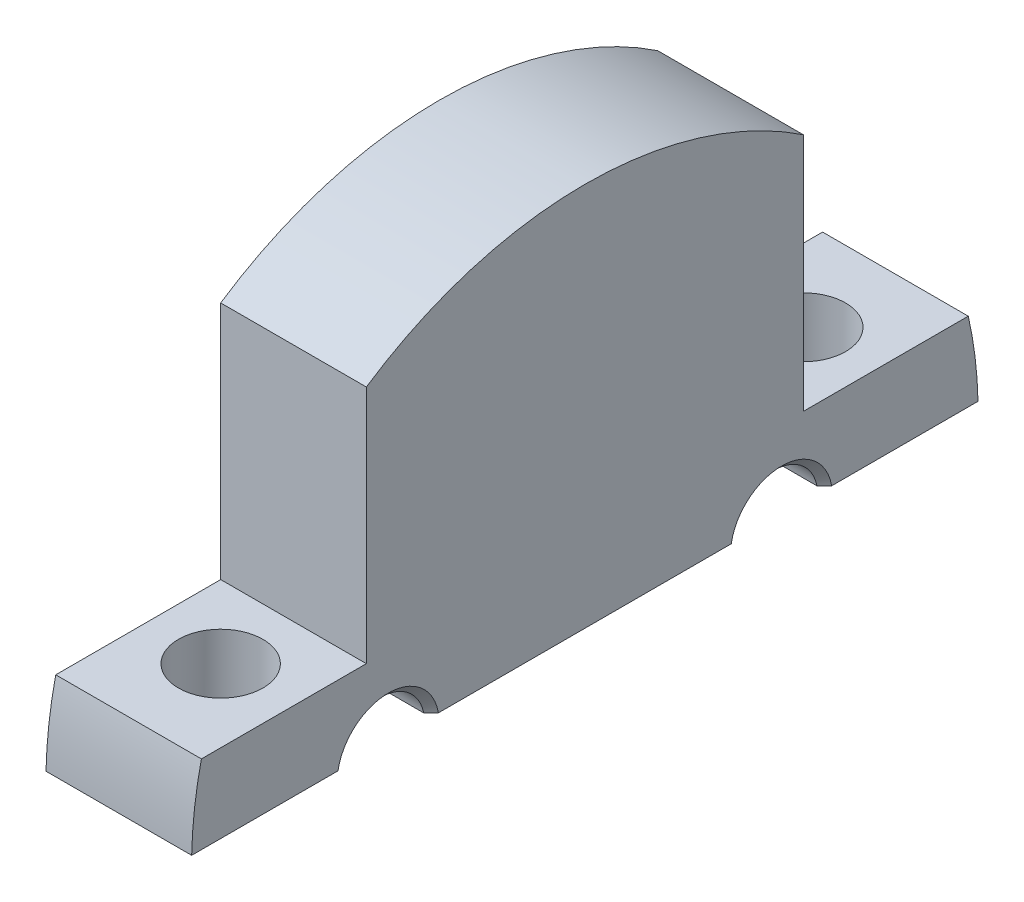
ISO-10303-21;
HEADER;
FILE_DESCRIPTION(('STEP AP214'),'2;1');
FILE_NAME('part.step','',(''),(''),'','','');
FILE_SCHEMA(('AUTOMOTIVE_DESIGN { 1 0 10303 214 1 1 1 1 }'));
ENDSEC;
DATA;
#1=APPLICATION_CONTEXT('core data for automotive mechanical design processes');
#2=APPLICATION_PROTOCOL_DEFINITION('international standard','automotive_design',2000,#1);
#3=PRODUCT_CONTEXT('',#1,'mechanical');
#4=PRODUCT('Part','Part','',(#3));
#5=PRODUCT_RELATED_PRODUCT_CATEGORY('part','',(#4));
#6=PRODUCT_DEFINITION_FORMATION('','',#4);
#7=PRODUCT_DEFINITION_CONTEXT('part definition',#1,'design');
#8=PRODUCT_DEFINITION('design','',#6,#7);
#9=PRODUCT_DEFINITION_SHAPE('','',#8);
#10=(LENGTH_UNIT() NAMED_UNIT(*) SI_UNIT(.MILLI.,.METRE.));
#11=(NAMED_UNIT(*) PLANE_ANGLE_UNIT() SI_UNIT($,.RADIAN.));
#12=(NAMED_UNIT(*) SI_UNIT($,.STERADIAN.) SOLID_ANGLE_UNIT());
#13=UNCERTAINTY_MEASURE_WITH_UNIT(LENGTH_MEASURE(1.E-05),#10,'distance_accuracy_value','');
#14=(GEOMETRIC_REPRESENTATION_CONTEXT(3) GLOBAL_UNCERTAINTY_ASSIGNED_CONTEXT((#13)) GLOBAL_UNIT_ASSIGNED_CONTEXT((#10,
#11,#12)) REPRESENTATION_CONTEXT('',''));
#15=CARTESIAN_POINT('',(0.,0.,0.));
#16=DIRECTION('',(0.,0.,1.));
#17=DIRECTION('',(1.,0.,0.));
#18=AXIS2_PLACEMENT_3D('',#15,#16,#17);
#19=CARTESIAN_POINT('',(132.700000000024,0.,0.));
#20=DIRECTION('',(1.,0.,0.));
#21=DIRECTION('',(0.,1.,0.));
#22=AXIS2_PLACEMENT_3D('',#19,#20,#21);
#23=CYLINDRICAL_SURFACE('',#22,13.5);
#24=DIRECTION('',(1.,0.,0.));
#25=VECTOR('',#24,1.);
#26=CARTESIAN_POINT('',(132.700000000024,0.300000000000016,13.4966662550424));
#27=LINE('',#26,#25);
#28=CARTESIAN_POINT('',(132.700000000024,0.300000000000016,13.4966662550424));
#29=VERTEX_POINT('',#28);
#30=CARTESIAN_POINT('',(127.700000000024,0.300000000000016,13.4966662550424));
#31=VERTEX_POINT('',#30);
#32=EDGE_CURVE('E151',#29,#31,#27,.F.);
#33=ORIENTED_EDGE('',*,*,#32,.F.);
#34=CARTESIAN_POINT('',(132.700000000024,0.,0.));
#35=DIRECTION('',(1.,0.,0.));
#36=DIRECTION('',(0.,1.,0.));
#37=AXIS2_PLACEMENT_3D('',#34,#35,#36);
#38=CIRCLE('',#37,13.5);
#39=CARTESIAN_POINT('',(132.700000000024,2.99999999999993,13.1624465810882));
#40=VERTEX_POINT('',#39);
#41=EDGE_CURVE('E165',#40,#29,#38,.T.);
#42=ORIENTED_EDGE('',*,*,#41,.F.);
#43=DIRECTION('',(-1.,0.,0.));
#44=VECTOR('',#43,1.);
#45=CARTESIAN_POINT('',(132.700000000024,2.99999999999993,13.1624465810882));
#46=LINE('',#45,#44);
#47=CARTESIAN_POINT('',(127.700000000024,2.99999999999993,13.1624465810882));
#48=VERTEX_POINT('',#47);
#49=EDGE_CURVE('E347',#40,#48,#46,.T.);
#50=ORIENTED_EDGE('',*,*,#49,.T.);
#51=CARTESIAN_POINT('',(127.700000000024,0.,0.));
#52=DIRECTION('',(1.,0.,0.));
#53=DIRECTION('',(0.,1.,0.));
#54=AXIS2_PLACEMENT_3D('',#51,#52,#53);
#55=CIRCLE('',#54,13.5);
#56=EDGE_CURVE('E167',#48,#31,#55,.T.);
#57=ORIENTED_EDGE('',*,*,#56,.T.);
#58=EDGE_LOOP('',(#33,#42,#50,#57));
#59=FACE_BOUND('',#58,.T.);
#60=ADVANCED_FACE('F32',(#59),#23,.T.);
#61=DIRECTION('',(-1.,0.,0.));
#62=VECTOR('',#61,1.);
#63=CARTESIAN_POINT('',(132.700000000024,11.2249721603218,7.5));
#64=LINE('',#63,#62);
#65=CARTESIAN_POINT('',(132.700000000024,11.2249721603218,7.5));
#66=VERTEX_POINT('',#65);
#67=CARTESIAN_POINT('',(127.700000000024,11.2249721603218,7.5));
#68=VERTEX_POINT('',#67);
#69=EDGE_CURVE('E328',#66,#68,#64,.T.);
#70=ORIENTED_EDGE('',*,*,#69,.F.);
#71=CARTESIAN_POINT('',(132.700000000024,11.2249721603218,-7.5));
#72=VERTEX_POINT('',#71);
#73=EDGE_CURVE('E175',#72,#66,#38,.T.);
#74=ORIENTED_EDGE('',*,*,#73,.F.);
#75=DIRECTION('',(-1.,0.,0.));
#76=VECTOR('',#75,1.);
#77=CARTESIAN_POINT('',(132.700000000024,11.2249721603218,-7.5));
#78=LINE('',#77,#76);
#79=CARTESIAN_POINT('',(127.700000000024,11.2249721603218,-7.5));
#80=VERTEX_POINT('',#79);
#81=EDGE_CURVE('E176',#72,#80,#78,.T.);
#82=ORIENTED_EDGE('',*,*,#81,.T.);
#83=EDGE_CURVE('E188',#80,#68,#55,.T.);
#84=ORIENTED_EDGE('',*,*,#83,.T.);
#85=EDGE_LOOP('',(#70,#74,#82,#84));
#86=FACE_BOUND('',#85,.T.);
#87=ADVANCED_FACE('F283',(#86),#23,.T.);
#88=CARTESIAN_POINT('',(127.700000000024,0.,0.));
#89=DIRECTION('',(-1.,0.,0.));
#90=DIRECTION('',(0.,-1.,0.));
#91=AXIS2_PLACEMENT_3D('',#88,#89,#90);
#92=PLANE('',#91);
#93=DIRECTION('',(0.,0.,-1.));
#94=VECTOR('',#93,1.);
#95=CARTESIAN_POINT('',(127.700000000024,0.300000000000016,-13.5));
#96=LINE('',#95,#94);
#97=CARTESIAN_POINT('',(127.700000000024,0.300000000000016,8.47409396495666));
#98=VERTEX_POINT('',#97);
#99=EDGE_CURVE('E382',#31,#98,#96,.T.);
#100=ORIENTED_EDGE('',*,*,#99,.F.);
#101=ORIENTED_EDGE('',*,*,#56,.F.);
#102=DIRECTION('',(0.,0.,1.));
#103=VECTOR('',#102,1.);
#104=CARTESIAN_POINT('',(127.700000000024,2.99999999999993,7.5));
#105=LINE('',#104,#103);
#106=CARTESIAN_POINT('',(127.700000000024,2.99999999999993,7.5));
#107=VERTEX_POINT('',#106);
#108=EDGE_CURVE('E354',#107,#48,#105,.T.);
#109=ORIENTED_EDGE('',*,*,#108,.F.);
#110=DIRECTION('',(0.,-1.,0.));
#111=VECTOR('',#110,1.);
#112=CARTESIAN_POINT('',(127.700000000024,11.2249721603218,7.5));
#113=LINE('',#112,#111);
#114=EDGE_CURVE('E353',#68,#107,#113,.T.);
#115=ORIENTED_EDGE('',*,*,#114,.F.);
#116=ORIENTED_EDGE('',*,*,#83,.F.);
#117=DIRECTION('',(0.,1.,0.));
#118=VECTOR('',#117,1.);
#119=CARTESIAN_POINT('',(127.700000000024,11.2249721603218,-7.5));
#120=LINE('',#119,#118);
#121=CARTESIAN_POINT('',(127.700000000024,2.99999999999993,-7.5));
#122=VERTEX_POINT('',#121);
#123=EDGE_CURVE('E341',#122,#80,#120,.T.);
#124=ORIENTED_EDGE('',*,*,#123,.F.);
#125=DIRECTION('',(0.,0.,1.));
#126=VECTOR('',#125,1.);
#127=CARTESIAN_POINT('',(127.700000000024,2.99999999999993,-7.5));
#128=LINE('',#127,#126);
#129=CARTESIAN_POINT('',(127.700000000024,2.99999999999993,-13.1624465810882));
#130=VERTEX_POINT('',#129);
#131=EDGE_CURVE('E344',#130,#122,#128,.T.);
#132=ORIENTED_EDGE('',*,*,#131,.F.);
#133=CARTESIAN_POINT('',(127.700000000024,0.300000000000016,-13.4966662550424));
#134=VERTEX_POINT('',#133);
#135=EDGE_CURVE('E189',#134,#130,#55,.T.);
#136=ORIENTED_EDGE('',*,*,#135,.F.);
#137=CARTESIAN_POINT('',(127.700000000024,0.300000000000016,-8.47409396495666));
#138=VERTEX_POINT('',#137);
#139=EDGE_CURVE('E387',#138,#134,#96,.T.);
#140=ORIENTED_EDGE('',*,*,#139,.F.);
#141=CARTESIAN_POINT('',(127.700000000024,0.,-6.75));
#142=DIRECTION('',(-1.,0.,0.));
#143=DIRECTION('',(0.,-1.,0.));
#144=AXIS2_PLACEMENT_3D('',#141,#142,#143);
#145=CIRCLE('',#144,1.75000000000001);
#146=CARTESIAN_POINT('',(127.700000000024,0.300000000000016,-5.02590603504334));
#147=VERTEX_POINT('',#146);
#148=EDGE_CURVE('E210',#138,#147,#145,.F.);
#149=ORIENTED_EDGE('',*,*,#148,.T.);
#150=CARTESIAN_POINT('',(127.700000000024,0.300000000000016,5.02590603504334));
#151=VERTEX_POINT('',#150);
#152=EDGE_CURVE('E383',#151,#147,#96,.T.);
#153=ORIENTED_EDGE('',*,*,#152,.F.);
#154=CARTESIAN_POINT('',(127.700000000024,0.,6.75));
#155=DIRECTION('',(-1.,0.,0.));
#156=DIRECTION('',(0.,-1.,0.));
#157=AXIS2_PLACEMENT_3D('',#154,#155,#156);
#158=CIRCLE('',#157,1.75000000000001);
#159=EDGE_CURVE('E205',#151,#98,#158,.F.);
#160=ORIENTED_EDGE('',*,*,#159,.T.);
#161=EDGE_LOOP('',(#100,#101,#109,#115,#116,#124,#132,#136,#140,#149,#153,#160));
#162=FACE_BOUND('',#161,.T.);
#163=ADVANCED_FACE('F279',(#162),#92,.T.);
#164=DIRECTION('',(1.,0.,0.));
#165=VECTOR('',#164,1.);
#166=CARTESIAN_POINT('',(132.700000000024,0.300000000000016,-13.4966662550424));
#167=LINE('',#166,#165);
#168=CARTESIAN_POINT('',(132.700000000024,0.300000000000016,-13.4966662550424));
#169=VERTEX_POINT('',#168);
#170=EDGE_CURVE('E169',#134,#169,#167,.T.);
#171=ORIENTED_EDGE('',*,*,#170,.F.);
#172=ORIENTED_EDGE('',*,*,#135,.T.);
#173=DIRECTION('',(-1.,0.,0.));
#174=VECTOR('',#173,1.);
#175=CARTESIAN_POINT('',(132.700000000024,2.99999999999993,-13.1624465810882));
#176=LINE('',#175,#174);
#177=CARTESIAN_POINT('',(132.700000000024,2.99999999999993,-13.1624465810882));
#178=VERTEX_POINT('',#177);
#179=EDGE_CURVE('E339',#178,#130,#176,.T.);
#180=ORIENTED_EDGE('',*,*,#179,.F.);
#181=EDGE_CURVE('E178',#169,#178,#38,.T.);
#182=ORIENTED_EDGE('',*,*,#181,.F.);
#183=EDGE_LOOP('',(#171,#172,#180,#182));
#184=FACE_BOUND('',#183,.T.);
#185=ADVANCED_FACE('F282',(#184),#23,.T.);
#186=CARTESIAN_POINT('',(132.700000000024,0.,-8.64999999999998));
#187=DIRECTION('',(1.,0.,0.));
#188=DIRECTION('',(0.,1.,0.));
#189=AXIS2_PLACEMENT_3D('',#186,#187,#188);
#190=PLANE('',#189);
#191=DIRECTION('',(0.,0.,-1.));
#192=VECTOR('',#191,1.);
#193=CARTESIAN_POINT('',(132.700000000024,0.300000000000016,-13.5));
#194=LINE('',#193,#192);
#195=CARTESIAN_POINT('',(132.700000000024,0.300000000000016,-8.47409396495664));
#196=VERTEX_POINT('',#195);
#197=EDGE_CURVE('E59',#196,#169,#194,.T.);
#198=ORIENTED_EDGE('',*,*,#197,.T.);
#199=ORIENTED_EDGE('',*,*,#181,.T.);
#200=DIRECTION('',(0.,0.,1.));
#201=VECTOR('',#200,1.);
#202=CARTESIAN_POINT('',(132.700000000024,2.99999999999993,-7.5));
#203=LINE('',#202,#201);
#204=CARTESIAN_POINT('',(132.700000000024,2.99999999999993,-7.5));
#205=VERTEX_POINT('',#204);
#206=EDGE_CURVE('E337',#178,#205,#203,.T.);
#207=ORIENTED_EDGE('',*,*,#206,.T.);
#208=DIRECTION('',(0.,1.,0.));
#209=VECTOR('',#208,1.);
#210=CARTESIAN_POINT('',(132.700000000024,11.2249721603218,-7.5));
#211=LINE('',#210,#209);
#212=EDGE_CURVE('E336',#205,#72,#211,.T.);
#213=ORIENTED_EDGE('',*,*,#212,.T.);
#214=ORIENTED_EDGE('',*,*,#73,.T.);
#215=DIRECTION('',(0.,-1.,0.));
#216=VECTOR('',#215,1.);
#217=CARTESIAN_POINT('',(132.700000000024,11.2249721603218,7.5));
#218=LINE('',#217,#216);
#219=CARTESIAN_POINT('',(132.700000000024,2.99999999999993,7.5));
#220=VERTEX_POINT('',#219);
#221=EDGE_CURVE('E335',#66,#220,#218,.T.);
#222=ORIENTED_EDGE('',*,*,#221,.T.);
#223=DIRECTION('',(0.,0.,1.));
#224=VECTOR('',#223,1.);
#225=CARTESIAN_POINT('',(132.700000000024,2.99999999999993,7.5));
#226=LINE('',#225,#224);
#227=EDGE_CURVE('E174',#220,#40,#226,.T.);
#228=ORIENTED_EDGE('',*,*,#227,.T.);
#229=ORIENTED_EDGE('',*,*,#41,.T.);
#230=CARTESIAN_POINT('',(132.700000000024,0.300000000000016,8.47409396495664));
#231=VERTEX_POINT('',#230);
#232=EDGE_CURVE('E147',#29,#231,#194,.T.);
#233=ORIENTED_EDGE('',*,*,#232,.T.);
#234=CARTESIAN_POINT('',(132.700000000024,0.,6.75));
#235=DIRECTION('',(1.,0.,0.));
#236=DIRECTION('',(0.,1.,0.));
#237=AXIS2_PLACEMENT_3D('',#234,#235,#236);
#238=CIRCLE('',#237,1.74999999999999);
#239=CARTESIAN_POINT('',(132.700000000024,0.300000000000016,5.02590603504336));
#240=VERTEX_POINT('',#239);
#241=EDGE_CURVE('E221',#231,#240,#238,.F.);
#242=ORIENTED_EDGE('',*,*,#241,.T.);
#243=CARTESIAN_POINT('',(132.700000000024,0.300000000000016,-5.02590603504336));
#244=VERTEX_POINT('',#243);
#245=EDGE_CURVE('E159',#240,#244,#194,.T.);
#246=ORIENTED_EDGE('',*,*,#245,.T.);
#247=CARTESIAN_POINT('',(132.700000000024,0.,-6.75));
#248=DIRECTION('',(1.,0.,0.));
#249=DIRECTION('',(0.,1.,0.));
#250=AXIS2_PLACEMENT_3D('',#247,#248,#249);
#251=CIRCLE('',#250,1.74999999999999);
#252=EDGE_CURVE('E219',#244,#196,#251,.F.);
#253=ORIENTED_EDGE('',*,*,#252,.T.);
#254=EDGE_LOOP('',(#198,#199,#207,#213,#214,#222,#228,#229,#233,#242,#246,#253));
#255=FACE_BOUND('',#254,.T.);
#256=ADVANCED_FACE('F172',(#255),#190,.T.);
#257=CARTESIAN_POINT('',(132.700000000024,0.,-6.75));
#258=DIRECTION('',(-1.,0.,0.));
#259=DIRECTION('',(0.,-1.,0.));
#260=AXIS2_PLACEMENT_3D('',#257,#258,#259);
#261=CYLINDRICAL_SURFACE('',#260,1.5);
#262=CARTESIAN_POINT('',(127.950000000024,0.,-6.75));
#263=DIRECTION('',(-1.,0.,0.));
#264=DIRECTION('',(0.,-1.,0.));
#265=AXIS2_PLACEMENT_3D('',#262,#263,#264);
#266=CIRCLE('',#265,1.5);
#267=CARTESIAN_POINT('',(127.950000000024,0.300000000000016,-5.28030615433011));
#268=VERTEX_POINT('',#267);
#269=CARTESIAN_POINT('',(127.950000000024,0.300000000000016,-8.21969384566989));
#270=VERTEX_POINT('',#269);
#271=EDGE_CURVE('E199',#268,#270,#266,.T.);
#272=ORIENTED_EDGE('',*,*,#271,.T.);
#273=DIRECTION('',(-1.,0.,0.));
#274=VECTOR('',#273,1.);
#275=CARTESIAN_POINT('',(132.700000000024,0.300000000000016,-8.21969384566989));
#276=LINE('',#275,#274);
#277=CARTESIAN_POINT('',(132.450000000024,0.300000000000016,-8.21969384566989));
#278=VERTEX_POINT('',#277);
#279=EDGE_CURVE('E231',#270,#278,#276,.F.);
#280=ORIENTED_EDGE('',*,*,#279,.T.);
#281=CARTESIAN_POINT('',(132.450000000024,0.,-6.75));
#282=DIRECTION('',(1.,0.,0.));
#283=DIRECTION('',(0.,1.,0.));
#284=AXIS2_PLACEMENT_3D('',#281,#282,#283);
#285=CIRCLE('',#284,1.5);
#286=CARTESIAN_POINT('',(132.450000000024,0.300000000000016,-5.28030615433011));
#287=VERTEX_POINT('',#286);
#288=EDGE_CURVE('E192',#278,#287,#285,.T.);
#289=ORIENTED_EDGE('',*,*,#288,.T.);
#290=DIRECTION('',(-1.,0.,0.));
#291=VECTOR('',#290,1.);
#292=CARTESIAN_POINT('',(132.700000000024,0.300000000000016,-5.28030615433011));
#293=LINE('',#292,#291);
#294=EDGE_CURVE('E158',#287,#268,#293,.T.);
#295=ORIENTED_EDGE('',*,*,#294,.T.);
#296=EDGE_LOOP('',(#272,#280,#289,#295));
#297=FACE_BOUND('',#296,.T.);
#298=ADVANCED_FACE('F233',(#297),#261,.F.);
#299=CARTESIAN_POINT('',(132.700000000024,0.,6.75));
#300=DIRECTION('',(-1.,0.,0.));
#301=DIRECTION('',(0.,-1.,0.));
#302=AXIS2_PLACEMENT_3D('',#299,#300,#301);
#303=CYLINDRICAL_SURFACE('',#302,1.5);
#304=CARTESIAN_POINT('',(127.950000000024,0.,6.75));
#305=DIRECTION('',(-1.,0.,0.));
#306=DIRECTION('',(0.,-1.,0.));
#307=AXIS2_PLACEMENT_3D('',#304,#305,#306);
#308=CIRCLE('',#307,1.5);
#309=CARTESIAN_POINT('',(127.950000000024,0.300000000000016,8.21969384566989));
#310=VERTEX_POINT('',#309);
#311=CARTESIAN_POINT('',(127.950000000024,0.300000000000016,5.28030615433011));
#312=VERTEX_POINT('',#311);
#313=EDGE_CURVE('E216',#310,#312,#308,.T.);
#314=ORIENTED_EDGE('',*,*,#313,.T.);
#315=DIRECTION('',(-1.,0.,0.));
#316=VECTOR('',#315,1.);
#317=CARTESIAN_POINT('',(132.700000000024,0.300000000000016,5.28030615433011));
#318=LINE('',#317,#316);
#319=CARTESIAN_POINT('',(132.450000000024,0.300000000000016,5.28030615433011));
#320=VERTEX_POINT('',#319);
#321=EDGE_CURVE('E268',#312,#320,#318,.F.);
#322=ORIENTED_EDGE('',*,*,#321,.T.);
#323=CARTESIAN_POINT('',(132.450000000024,0.,6.75));
#324=DIRECTION('',(1.,0.,0.));
#325=DIRECTION('',(0.,1.,0.));
#326=AXIS2_PLACEMENT_3D('',#323,#324,#325);
#327=CIRCLE('',#326,1.5);
#328=CARTESIAN_POINT('',(132.450000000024,0.300000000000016,8.21969384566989));
#329=VERTEX_POINT('',#328);
#330=EDGE_CURVE('E213',#320,#329,#327,.T.);
#331=ORIENTED_EDGE('',*,*,#330,.T.);
#332=DIRECTION('',(-1.,0.,0.));
#333=VECTOR('',#332,1.);
#334=CARTESIAN_POINT('',(132.700000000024,0.300000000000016,8.21969384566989));
#335=LINE('',#334,#333);
#336=EDGE_CURVE('E52',#329,#310,#335,.T.);
#337=ORIENTED_EDGE('',*,*,#336,.T.);
#338=EDGE_LOOP('',(#314,#322,#331,#337));
#339=FACE_BOUND('',#338,.T.);
#340=ADVANCED_FACE('F291',(#339),#303,.F.);
#341=CARTESIAN_POINT('',(132.700000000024,11.2249721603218,-7.5));
#342=DIRECTION('',(0.,0.,1.));
#343=DIRECTION('',(1.,0.,0.));
#344=AXIS2_PLACEMENT_3D('',#341,#342,#343);
#345=PLANE('',#344);
#346=ORIENTED_EDGE('',*,*,#123,.T.);
#347=ORIENTED_EDGE('',*,*,#81,.F.);
#348=ORIENTED_EDGE('',*,*,#212,.F.);
#349=DIRECTION('',(-1.,0.,0.));
#350=VECTOR('',#349,1.);
#351=CARTESIAN_POINT('',(132.700000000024,2.99999999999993,-7.5));
#352=LINE('',#351,#350);
#353=EDGE_CURVE('E181',#205,#122,#352,.T.);
#354=ORIENTED_EDGE('',*,*,#353,.T.);
#355=EDGE_LOOP('',(#346,#347,#348,#354));
#356=FACE_BOUND('',#355,.T.);
#357=ADVANCED_FACE('F294',(#356),#345,.F.);
#358=CARTESIAN_POINT('',(132.700000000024,2.99999999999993,-7.5));
#359=DIRECTION('',(0.,-1.,0.));
#360=DIRECTION('',(0.,0.,-1.));
#361=AXIS2_PLACEMENT_3D('',#358,#359,#360);
#362=PLANE('',#361);
#363=CARTESIAN_POINT('',(130.200000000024,2.99999999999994,-10.));
#364=DIRECTION('',(0.,1.,0.));
#365=DIRECTION('',(0.,0.,1.));
#366=AXIS2_PLACEMENT_3D('',#363,#364,#365);
#367=CIRCLE('',#366,1.44999999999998);
#368=CARTESIAN_POINT('',(130.200000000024,2.99999999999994,-8.55000000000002));
#369=VERTEX_POINT('',#368);
#370=EDGE_CURVE('E356',#369,#369,#367,.T.);
#371=ORIENTED_EDGE('',*,*,#370,.F.);
#372=EDGE_LOOP('',(#371));
#373=FACE_BOUND('',#372,.T.);
#374=ORIENTED_EDGE('',*,*,#131,.T.);
#375=ORIENTED_EDGE('',*,*,#353,.F.);
#376=ORIENTED_EDGE('',*,*,#206,.F.);
#377=ORIENTED_EDGE('',*,*,#179,.T.);
#378=EDGE_LOOP('',(#374,#375,#376,#377));
#379=FACE_BOUND('',#378,.T.);
#380=ADVANCED_FACE('F296',(#373,#379),#362,.F.);
#381=CARTESIAN_POINT('',(132.700000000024,2.99999999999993,7.5));
#382=DIRECTION('',(0.,-1.,0.));
#383=DIRECTION('',(0.,0.,-1.));
#384=AXIS2_PLACEMENT_3D('',#381,#382,#383);
#385=PLANE('',#384);
#386=CARTESIAN_POINT('',(130.200000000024,2.99999999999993,10.));
#387=DIRECTION('',(0.,1.,0.));
#388=DIRECTION('',(0.,0.,1.));
#389=AXIS2_PLACEMENT_3D('',#386,#387,#388);
#390=CIRCLE('',#389,1.44999999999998);
#391=CARTESIAN_POINT('',(130.200000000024,2.99999999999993,11.45));
#392=VERTEX_POINT('',#391);
#393=EDGE_CURVE('E168',#392,#392,#390,.T.);
#394=ORIENTED_EDGE('',*,*,#393,.F.);
#395=EDGE_LOOP('',(#394));
#396=FACE_BOUND('',#395,.T.);
#397=ORIENTED_EDGE('',*,*,#108,.T.);
#398=ORIENTED_EDGE('',*,*,#49,.F.);
#399=ORIENTED_EDGE('',*,*,#227,.F.);
#400=DIRECTION('',(-1.,0.,0.));
#401=VECTOR('',#400,1.);
#402=CARTESIAN_POINT('',(132.700000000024,2.99999999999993,7.5));
#403=LINE('',#402,#401);
#404=EDGE_CURVE('E332',#220,#107,#403,.T.);
#405=ORIENTED_EDGE('',*,*,#404,.T.);
#406=EDGE_LOOP('',(#397,#398,#399,#405));
#407=FACE_BOUND('',#406,.T.);
#408=ADVANCED_FACE('F299',(#396,#407),#385,.F.);
#409=CARTESIAN_POINT('',(132.700000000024,11.2249721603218,7.5));
#410=DIRECTION('',(0.,0.,-1.));
#411=DIRECTION('',(-1.,0.,0.));
#412=AXIS2_PLACEMENT_3D('',#409,#410,#411);
#413=PLANE('',#412);
#414=ORIENTED_EDGE('',*,*,#114,.T.);
#415=ORIENTED_EDGE('',*,*,#404,.F.);
#416=ORIENTED_EDGE('',*,*,#221,.F.);
#417=ORIENTED_EDGE('',*,*,#69,.T.);
#418=EDGE_LOOP('',(#414,#415,#416,#417));
#419=FACE_BOUND('',#418,.T.);
#420=ADVANCED_FACE('F304',(#419),#413,.F.);
#421=CARTESIAN_POINT('',(130.200000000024,2.99999999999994,-10.));
#422=DIRECTION('',(0.,1.,0.));
#423=DIRECTION('',(0.,0.,1.));
#424=AXIS2_PLACEMENT_3D('',#421,#422,#423);
#425=CYLINDRICAL_SURFACE('',#424,1.44999999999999);
#426=CARTESIAN_POINT('',(130.200000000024,0.300000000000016,-10.));
#427=DIRECTION('',(0.,1.,0.));
#428=DIRECTION('',(-1.,0.,0.));
#429=AXIS2_PLACEMENT_3D('',#426,#427,#428);
#430=CIRCLE('',#429,1.44999999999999);
#431=CARTESIAN_POINT('',(128.750000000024,0.300000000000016,-10.));
#432=VERTEX_POINT('',#431);
#433=EDGE_CURVE('E370',#432,#432,#430,.F.);
#434=ORIENTED_EDGE('',*,*,#433,.T.);
#435=EDGE_LOOP('',(#434));
#436=FACE_BOUND('',#435,.T.);
#437=ORIENTED_EDGE('',*,*,#370,.T.);
#438=EDGE_LOOP('',(#437));
#439=FACE_BOUND('',#438,.T.);
#440=ADVANCED_FACE('F307',(#436,#439),#425,.F.);
#441=CARTESIAN_POINT('',(130.200000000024,2.99999999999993,10.));
#442=DIRECTION('',(0.,1.,0.));
#443=DIRECTION('',(0.,0.,1.));
#444=AXIS2_PLACEMENT_3D('',#441,#442,#443);
#445=CYLINDRICAL_SURFACE('',#444,1.44999999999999);
#446=CARTESIAN_POINT('',(130.200000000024,0.300000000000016,10.));
#447=DIRECTION('',(0.,1.,0.));
#448=DIRECTION('',(-1.,0.,0.));
#449=AXIS2_PLACEMENT_3D('',#446,#447,#448);
#450=CIRCLE('',#449,1.44999999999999);
#451=CARTESIAN_POINT('',(128.750000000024,0.300000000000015,10.));
#452=VERTEX_POINT('',#451);
#453=EDGE_CURVE('E371',#452,#452,#450,.F.);
#454=ORIENTED_EDGE('',*,*,#453,.T.);
#455=EDGE_LOOP('',(#454));
#456=FACE_BOUND('',#455,.T.);
#457=ORIENTED_EDGE('',*,*,#393,.T.);
#458=EDGE_LOOP('',(#457));
#459=FACE_BOUND('',#458,.T.);
#460=ADVANCED_FACE('F257',(#456,#459),#445,.F.);
#461=CARTESIAN_POINT('',(127.950000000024,0.,-6.75));
#462=DIRECTION('',(-1.,0.,0.));
#463=DIRECTION('',(0.,-1.,0.));
#464=AXIS2_PLACEMENT_3D('',#461,#462,#463);
#465=CONICAL_SURFACE('',#464,1.5,0.78539816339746);
#466=CARTESIAN_POINT('',(125.594449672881,0.300000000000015,-2.906138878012));
#467=CARTESIAN_POINT('',(125.730486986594,0.300000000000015,-3.04259368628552));
#468=CARTESIAN_POINT('',(125.866505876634,0.300000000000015,-3.1790668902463));
#469=CARTESIAN_POINT('',(126.138486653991,0.300000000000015,-3.45208109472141));
#470=CARTESIAN_POINT('',(126.274448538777,0.300000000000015,-3.58862209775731));
#471=CARTESIAN_POINT('',(126.546417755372,0.300000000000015,-3.86192614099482));
#472=CARTESIAN_POINT('',(126.682425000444,0.300000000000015,-3.99868926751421));
#473=CARTESIAN_POINT('',(126.954298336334,0.300000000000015,-4.27234513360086));
#474=CARTESIAN_POINT('',(127.090164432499,0.300000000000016,-4.40923786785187));
#475=CARTESIAN_POINT('',(127.35522866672,0.300000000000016,-4.67674768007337));
#476=CARTESIAN_POINT('',(127.484437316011,0.300000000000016,-4.80735434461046));
#477=CARTESIAN_POINT('',(127.742513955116,0.300000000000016,-5.06893388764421));
#478=CARTESIAN_POINT('',(127.871381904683,0.300000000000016,-5.19990680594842));
#479=CARTESIAN_POINT('',(128.064083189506,0.300000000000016,-5.39687659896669));
#480=CARTESIAN_POINT('',(128.128197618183,0.300000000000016,-5.46259838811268));
#481=CARTESIAN_POINT('',(128.256134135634,0.300000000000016,-5.59433249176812));
#482=CARTESIAN_POINT('',(128.319956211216,0.300000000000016,-5.66034481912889));
#483=CARTESIAN_POINT('',(128.447090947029,0.300000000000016,-5.79283134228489));
#484=CARTESIAN_POINT('',(128.510403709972,0.300000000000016,-5.85930543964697));
#485=CARTESIAN_POINT('',(128.636140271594,0.300000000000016,-5.99308780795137));
#486=CARTESIAN_POINT('',(128.698564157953,0.300000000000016,-6.06039599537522));
#487=CARTESIAN_POINT('',(128.777062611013,0.300000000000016,-6.14758136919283));
#488=CARTESIAN_POINT('',(128.79406461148,0.300000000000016,-6.16662137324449));
#489=CARTESIAN_POINT('',(128.827857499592,0.300000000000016,-6.20489154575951));
#490=CARTESIAN_POINT('',(128.844648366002,0.300000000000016,-6.22412173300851));
#491=CARTESIAN_POINT('',(128.878079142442,0.300000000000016,-6.26297623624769));
#492=CARTESIAN_POINT('',(128.894716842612,0.300000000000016,-6.28260245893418));
#493=CARTESIAN_POINT('',(128.927593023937,0.300000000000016,-6.32217911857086));
#494=CARTESIAN_POINT('',(128.943831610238,0.300000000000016,-6.34212946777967));
#495=CARTESIAN_POINT('',(128.975888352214,0.300000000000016,-6.38266154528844));
#496=CARTESIAN_POINT('',(128.991701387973,0.300000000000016,-6.40324734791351));
#497=CARTESIAN_POINT('',(129.022460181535,0.300000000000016,-6.44505507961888));
#498=CARTESIAN_POINT('',(129.037406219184,0.300000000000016,-6.46627680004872));
#499=CARTESIAN_POINT('',(129.065838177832,0.300000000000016,-6.50949091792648));
#500=CARTESIAN_POINT('',(129.079333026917,0.300000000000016,-6.53147735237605));
#501=CARTESIAN_POINT('',(129.104045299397,0.300000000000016,-6.57667239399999));
#502=CARTESIAN_POINT('',(129.115269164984,0.300000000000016,-6.59987730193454));
#503=CARTESIAN_POINT('',(129.13157516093,0.300000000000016,-6.64196917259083));
#504=CARTESIAN_POINT('',(129.137488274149,0.300000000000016,-6.66052148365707));
#505=CARTESIAN_POINT('',(129.146129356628,0.300000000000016,-6.69831457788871));
#506=CARTESIAN_POINT('',(129.148871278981,0.300000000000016,-6.71755195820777));
#507=CARTESIAN_POINT('',(129.150561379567,0.300000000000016,-6.75634958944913));
#508=CARTESIAN_POINT('',(129.149481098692,0.300000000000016,-6.77591117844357));
#509=CARTESIAN_POINT('',(129.143741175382,0.300000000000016,-6.81452795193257));
#510=CARTESIAN_POINT('',(129.13906980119,0.300000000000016,-6.8335812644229));
#511=CARTESIAN_POINT('',(129.127268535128,0.300000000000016,-6.87020119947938));
#512=CARTESIAN_POINT('',(129.120220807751,0.300000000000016,-6.88779575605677));
#513=CARTESIAN_POINT('',(129.104422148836,0.300000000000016,-6.92221575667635));
#514=CARTESIAN_POINT('',(129.095668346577,0.300000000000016,-6.93903984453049));
#515=CARTESIAN_POINT('',(129.076944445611,0.300000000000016,-6.97216833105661));
#516=CARTESIAN_POINT('',(129.066964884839,0.300000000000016,-6.98846727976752));
#517=CARTESIAN_POINT('',(129.046218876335,0.300000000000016,-7.02053153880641));
#518=CARTESIAN_POINT('',(129.03545306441,0.300000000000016,-7.03629726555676));
#519=CARTESIAN_POINT('',(129.000519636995,0.300000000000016,-7.08556685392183));
#520=CARTESIAN_POINT('',(128.975343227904,0.300000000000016,-7.11834990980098));
#521=CARTESIAN_POINT('',(128.923678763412,0.300000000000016,-7.18287225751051));
#522=CARTESIAN_POINT('',(128.897189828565,0.300000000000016,-7.21461082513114));
#523=CARTESIAN_POINT('',(128.843394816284,0.300000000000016,-7.27747987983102));
#524=CARTESIAN_POINT('',(128.816087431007,0.300000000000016,-7.3086092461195));
#525=CARTESIAN_POINT('',(128.760983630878,0.300000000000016,-7.37043315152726));
#526=CARTESIAN_POINT('',(128.733187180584,0.300000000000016,-7.40112765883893));
#527=CARTESIAN_POINT('',(128.649482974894,0.300000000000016,-7.49259024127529));
#528=CARTESIAN_POINT('',(128.593098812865,0.300000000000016,-7.55292150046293));
#529=CARTESIAN_POINT('',(128.479751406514,0.300000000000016,-7.67290478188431));
#530=CARTESIAN_POINT('',(128.422788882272,0.300000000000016,-7.73255748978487));
#531=CARTESIAN_POINT('',(128.251549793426,0.300000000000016,-7.91077352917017));
#532=CARTESIAN_POINT('',(128.136722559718,0.300000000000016,-8.02880725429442));
#533=CARTESIAN_POINT('',(127.906465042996,0.300000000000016,-8.26428727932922));
#534=CARTESIAN_POINT('',(127.791034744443,0.300000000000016,-8.38173356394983));
#535=CARTESIAN_POINT('',(127.559780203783,0.300000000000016,-8.6163679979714));
#536=CARTESIAN_POINT('',(127.443955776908,0.300000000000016,-8.73355596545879));
#537=CARTESIAN_POINT('',(127.21211820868,0.300000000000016,-8.96774240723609));
#538=CARTESIAN_POINT('',(127.096105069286,0.300000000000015,-9.08474088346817));
#539=CARTESIAN_POINT('',(126.749344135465,0.300000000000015,-9.43409340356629));
#540=CARTESIAN_POINT('',(126.518421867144,0.300000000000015,-9.66627427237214));
#541=CARTESIAN_POINT('',(126.171947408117,0.300000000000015,-10.0143128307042));
#542=CARTESIAN_POINT('',(126.056476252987,0.300000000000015,-10.1302512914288));
#543=CARTESIAN_POINT('',(125.825491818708,0.300000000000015,-10.3620853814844));
#544=CARTESIAN_POINT('',(125.709978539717,0.300000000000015,-10.4779810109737));
#545=CARTESIAN_POINT('',(125.594449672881,0.300000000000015,-10.593861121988));
#546=B_SPLINE_CURVE_WITH_KNOTS('',3,(#466,#467,#468,#469,#470,#471,#472,#473,#474,#475,#476,
#477,#478,#479,#480,#481,#482,#483,#484,#485,#486,#487,#488,#489,#490,#491,#492,#493,#494,#495,
#496,#497,#498,#499,#500,#501,#502,#503,#504,#505,#506,#507,#508,#509,#510,#511,#512,#513,#514,
#515,#516,#517,#518,#519,#520,#521,#522,#523,#524,#525,#526,#527,#528,#529,#530,#531,#532,#533,
#534,#535,#536,#537,#538,#539,#540,#541,#542,#543,#544,#545),.UNSPECIFIED.,.F.,.F.,(4,2,2,2,2,2,
2,2,2,2,2,2,2,2,2,2,2,2,2,2,2,2,2,2,2,2,2,2,2,2,2,2,2,2,2,2,2,2,2,4),(0.,0.578043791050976,
1.15611098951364,1.73474651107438,2.31335924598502,2.86451861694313,3.41574042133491,
3.69118539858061,3.96664268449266,4.24204295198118,4.51741586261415,4.59399341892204,
4.6705786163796,4.74776318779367,4.82492720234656,4.90278793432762,4.98062339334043,
5.05794868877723,5.13505145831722,5.19326761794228,5.25122664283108,5.30961812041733,
5.3682011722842,5.4249370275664,5.48176918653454,5.53907145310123,5.59632788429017,
5.72025215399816,5.84426061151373,5.96847907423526,6.09270657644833,6.34042690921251,
6.5878695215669,7.08188115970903,7.57590558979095,8.07020734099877,8.56450399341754,
9.54689724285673,10.0377921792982,10.5286852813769),.UNSPECIFIED.);
#547=EDGE_CURVE('E236',#147,#268,#546,.T.);
#548=ORIENTED_EDGE('',*,*,#547,.F.);
#549=ORIENTED_EDGE('',*,*,#148,.F.);
#550=EDGE_CURVE('E235',#270,#138,#546,.T.);
#551=ORIENTED_EDGE('',*,*,#550,.F.);
#552=ORIENTED_EDGE('',*,*,#271,.F.);
#553=EDGE_LOOP('',(#548,#549,#551,#552));
#554=FACE_BOUND('',#553,.T.);
#555=ADVANCED_FACE('F273',(#554),#465,.F.);
#556=CARTESIAN_POINT('',(127.950000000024,0.,6.75));
#557=DIRECTION('',(-1.,0.,0.));
#558=DIRECTION('',(0.,-1.,0.));
#559=AXIS2_PLACEMENT_3D('',#556,#557,#558);
#560=CONICAL_SURFACE('',#559,1.5,0.785398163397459);
#561=CARTESIAN_POINT('',(125.594449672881,0.300000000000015,10.593861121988));
#562=CARTESIAN_POINT('',(125.730486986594,0.300000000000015,10.4574063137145));
#563=CARTESIAN_POINT('',(125.866505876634,0.300000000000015,10.3209331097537));
#564=CARTESIAN_POINT('',(126.138486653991,0.300000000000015,10.0479189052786));
#565=CARTESIAN_POINT('',(126.274448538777,0.300000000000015,9.91137790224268));
#566=CARTESIAN_POINT('',(126.546417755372,0.300000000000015,9.63807385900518));
#567=CARTESIAN_POINT('',(126.682425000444,0.300000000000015,9.50131073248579));
#568=CARTESIAN_POINT('',(126.954298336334,0.300000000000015,9.22765486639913));
#569=CARTESIAN_POINT('',(127.090164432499,0.300000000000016,9.09076213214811));
#570=CARTESIAN_POINT('',(127.35522866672,0.300000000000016,8.8232523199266));
#571=CARTESIAN_POINT('',(127.484437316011,0.300000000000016,8.69264565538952));
#572=CARTESIAN_POINT('',(127.742513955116,0.300000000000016,8.43106611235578));
#573=CARTESIAN_POINT('',(127.871381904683,0.300000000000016,8.30009319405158));
#574=CARTESIAN_POINT('',(128.064083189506,0.300000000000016,8.1031234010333));
#575=CARTESIAN_POINT('',(128.128197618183,0.300000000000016,8.03740161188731));
#576=CARTESIAN_POINT('',(128.256134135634,0.300000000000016,7.90566750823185));
#577=CARTESIAN_POINT('',(128.319956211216,0.300000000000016,7.83965518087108));
#578=CARTESIAN_POINT('',(128.447090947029,0.300000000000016,7.70716865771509));
#579=CARTESIAN_POINT('',(128.510403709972,0.300000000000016,7.64069456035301));
#580=CARTESIAN_POINT('',(128.636140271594,0.300000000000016,7.50691219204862));
#581=CARTESIAN_POINT('',(128.698564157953,0.300000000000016,7.43960400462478));
#582=CARTESIAN_POINT('',(128.777062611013,0.300000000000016,7.35241863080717));
#583=CARTESIAN_POINT('',(128.79406461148,0.300000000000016,7.33337862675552));
#584=CARTESIAN_POINT('',(128.827857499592,0.300000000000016,7.29510845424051));
#585=CARTESIAN_POINT('',(128.844648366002,0.300000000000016,7.27587826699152));
#586=CARTESIAN_POINT('',(128.878079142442,0.300000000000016,7.23702376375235));
#587=CARTESIAN_POINT('',(128.894716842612,0.300000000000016,7.21739754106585));
#588=CARTESIAN_POINT('',(128.927593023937,0.300000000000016,7.17782088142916));
#589=CARTESIAN_POINT('',(128.943831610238,0.300000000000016,7.15787053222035));
#590=CARTESIAN_POINT('',(128.975888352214,0.300000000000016,7.11733845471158));
#591=CARTESIAN_POINT('',(128.991701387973,0.300000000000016,7.09675265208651));
#592=CARTESIAN_POINT('',(129.022460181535,0.300000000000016,7.05494492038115));
#593=CARTESIAN_POINT('',(129.037406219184,0.300000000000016,7.0337231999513));
#594=CARTESIAN_POINT('',(129.065838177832,0.300000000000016,6.99050908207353));
#595=CARTESIAN_POINT('',(129.079333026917,0.300000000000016,6.96852264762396));
#596=CARTESIAN_POINT('',(129.104045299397,0.300000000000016,6.92332760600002));
#597=CARTESIAN_POINT('',(129.115269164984,0.300000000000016,6.90012269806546));
#598=CARTESIAN_POINT('',(129.13157516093,0.300000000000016,6.85803082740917));
#599=CARTESIAN_POINT('',(129.137488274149,0.300000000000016,6.83947851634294));
#600=CARTESIAN_POINT('',(129.146129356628,0.300000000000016,6.80168542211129));
#601=CARTESIAN_POINT('',(129.148871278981,0.300000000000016,6.78244804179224));
#602=CARTESIAN_POINT('',(129.150561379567,0.300000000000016,6.74365041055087));
#603=CARTESIAN_POINT('',(129.149481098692,0.300000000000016,6.72408882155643));
#604=CARTESIAN_POINT('',(129.143741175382,0.300000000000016,6.68547204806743));
#605=CARTESIAN_POINT('',(129.13906980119,0.300000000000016,6.6664187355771));
#606=CARTESIAN_POINT('',(129.127268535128,0.300000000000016,6.62979880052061));
#607=CARTESIAN_POINT('',(129.120220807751,0.300000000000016,6.61220424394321));
#608=CARTESIAN_POINT('',(129.104422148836,0.300000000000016,6.57778424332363));
#609=CARTESIAN_POINT('',(129.095668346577,0.300000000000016,6.5609601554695));
#610=CARTESIAN_POINT('',(129.076944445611,0.300000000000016,6.52783166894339));
#611=CARTESIAN_POINT('',(129.066964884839,0.300000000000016,6.51153272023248));
#612=CARTESIAN_POINT('',(129.046218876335,0.300000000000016,6.47946846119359));
#613=CARTESIAN_POINT('',(129.03545306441,0.300000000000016,6.46370273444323));
#614=CARTESIAN_POINT('',(129.000519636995,0.300000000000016,6.41443314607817));
#615=CARTESIAN_POINT('',(128.975343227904,0.300000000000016,6.38165009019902));
#616=CARTESIAN_POINT('',(128.923678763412,0.300000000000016,6.31712774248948));
#617=CARTESIAN_POINT('',(128.897189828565,0.300000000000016,6.28538917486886));
#618=CARTESIAN_POINT('',(128.843394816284,0.300000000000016,6.22252012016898));
#619=CARTESIAN_POINT('',(128.816087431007,0.300000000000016,6.1913907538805));
#620=CARTESIAN_POINT('',(128.760983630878,0.300000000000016,6.12956684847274));
#621=CARTESIAN_POINT('',(128.733187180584,0.300000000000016,6.09887234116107));
#622=CARTESIAN_POINT('',(128.649482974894,0.300000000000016,6.00740975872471));
#623=CARTESIAN_POINT('',(128.593098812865,0.300000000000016,5.94707849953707));
#624=CARTESIAN_POINT('',(128.479751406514,0.300000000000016,5.82709521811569));
#625=CARTESIAN_POINT('',(128.422788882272,0.300000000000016,5.76744251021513));
#626=CARTESIAN_POINT('',(128.251549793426,0.300000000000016,5.58922647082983));
#627=CARTESIAN_POINT('',(128.136722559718,0.300000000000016,5.47119274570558));
#628=CARTESIAN_POINT('',(127.906465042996,0.300000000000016,5.23571272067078));
#629=CARTESIAN_POINT('',(127.791034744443,0.300000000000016,5.11826643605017));
#630=CARTESIAN_POINT('',(127.559780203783,0.300000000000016,4.8836320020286));
#631=CARTESIAN_POINT('',(127.443955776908,0.300000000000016,4.76644403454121));
#632=CARTESIAN_POINT('',(127.21211820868,0.300000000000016,4.53225759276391));
#633=CARTESIAN_POINT('',(127.096105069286,0.300000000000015,4.41525911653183));
#634=CARTESIAN_POINT('',(126.749344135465,0.300000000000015,4.06590659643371));
#635=CARTESIAN_POINT('',(126.518421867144,0.300000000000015,3.83372572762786));
#636=CARTESIAN_POINT('',(126.171947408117,0.300000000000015,3.48568716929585));
#637=CARTESIAN_POINT('',(126.056476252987,0.300000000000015,3.36974870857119));
#638=CARTESIAN_POINT('',(125.825491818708,0.300000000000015,3.13791461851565));
#639=CARTESIAN_POINT('',(125.709978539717,0.300000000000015,3.02201898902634));
#640=CARTESIAN_POINT('',(125.594449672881,0.300000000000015,2.90613887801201));
#641=B_SPLINE_CURVE_WITH_KNOTS('',3,(#561,#562,#563,#564,#565,#566,#567,#568,#569,#570,#571,
#572,#573,#574,#575,#576,#577,#578,#579,#580,#581,#582,#583,#584,#585,#586,#587,#588,#589,#590,
#591,#592,#593,#594,#595,#596,#597,#598,#599,#600,#601,#602,#603,#604,#605,#606,#607,#608,#609,
#610,#611,#612,#613,#614,#615,#616,#617,#618,#619,#620,#621,#622,#623,#624,#625,#626,#627,#628,
#629,#630,#631,#632,#633,#634,#635,#636,#637,#638,#639,#640),.UNSPECIFIED.,.F.,.F.,(4,2,2,2,2,2,
2,2,2,2,2,2,2,2,2,2,2,2,2,2,2,2,2,2,2,2,2,2,2,2,2,2,2,2,2,2,2,2,2,4),(0.,0.578043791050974,
1.15611098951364,1.7347465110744,2.31335924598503,2.86451861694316,3.41574042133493,
3.69118539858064,3.96664268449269,4.24204295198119,4.51741586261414,4.59399341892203,
4.67057861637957,4.7477631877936,4.82492720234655,4.90278793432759,4.98062339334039,
5.05794868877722,5.13505145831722,5.19326761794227,5.25122664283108,5.30961812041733,
5.3682011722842,5.42493702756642,5.48176918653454,5.53907145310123,5.59632788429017,
5.72025215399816,5.84426061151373,5.96847907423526,6.09270657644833,6.34042690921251,
6.58786952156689,7.08188115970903,7.57590558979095,8.07020734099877,8.56450399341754,
9.54689724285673,10.0377921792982,10.5286852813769),.UNSPECIFIED.);
#642=EDGE_CURVE('E262',#98,#310,#641,.T.);
#643=ORIENTED_EDGE('',*,*,#642,.F.);
#644=ORIENTED_EDGE('',*,*,#159,.F.);
#645=EDGE_CURVE('E267',#312,#151,#641,.T.);
#646=ORIENTED_EDGE('',*,*,#645,.F.);
#647=ORIENTED_EDGE('',*,*,#313,.F.);
#648=EDGE_LOOP('',(#643,#644,#646,#647));
#649=FACE_BOUND('',#648,.T.);
#650=ADVANCED_FACE('F270',(#649),#560,.F.);
#651=CARTESIAN_POINT('',(132.700000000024,0.,6.75));
#652=DIRECTION('',(1.,0.,0.));
#653=DIRECTION('',(0.,1.,0.));
#654=AXIS2_PLACEMENT_3D('',#651,#652,#653);
#655=CONICAL_SURFACE('',#654,1.74999999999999,0.785398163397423);
#656=CARTESIAN_POINT('',(134.805550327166,0.300000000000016,2.9061388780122));
#657=CARTESIAN_POINT('',(134.669513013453,0.300000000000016,3.04259368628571));
#658=CARTESIAN_POINT('',(134.533494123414,0.300000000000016,3.17906689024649));
#659=CARTESIAN_POINT('',(134.261513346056,0.300000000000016,3.45208109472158));
#660=CARTESIAN_POINT('',(134.12555146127,0.300000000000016,3.58862209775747));
#661=CARTESIAN_POINT('',(133.853582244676,0.300000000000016,3.86192614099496));
#662=CARTESIAN_POINT('',(133.717574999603,0.300000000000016,3.99868926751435));
#663=CARTESIAN_POINT('',(133.445701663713,0.300000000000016,4.27234513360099));
#664=CARTESIAN_POINT('',(133.309835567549,0.300000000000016,4.40923786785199));
#665=CARTESIAN_POINT('',(133.044771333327,0.300000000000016,4.67674768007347));
#666=CARTESIAN_POINT('',(132.915562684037,0.300000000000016,4.80735434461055));
#667=CARTESIAN_POINT('',(132.657486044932,0.300000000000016,5.06893388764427));
#668=CARTESIAN_POINT('',(132.528618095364,0.300000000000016,5.19990680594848));
#669=CARTESIAN_POINT('',(132.335916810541,0.300000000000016,5.39687659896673));
#670=CARTESIAN_POINT('',(132.271802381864,0.300000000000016,5.4625983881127));
#671=CARTESIAN_POINT('',(132.143865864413,0.300000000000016,5.59433249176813));
#672=CARTESIAN_POINT('',(132.080043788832,0.300000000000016,5.6603448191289));
#673=CARTESIAN_POINT('',(131.952909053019,0.300000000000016,5.79283134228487));
#674=CARTESIAN_POINT('',(131.889596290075,0.300000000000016,5.85930543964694));
#675=CARTESIAN_POINT('',(131.763859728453,0.300000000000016,5.99308780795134));
#676=CARTESIAN_POINT('',(131.701435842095,0.300000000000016,6.06039599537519));
#677=CARTESIAN_POINT('',(131.622937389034,0.300000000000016,6.1475813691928));
#678=CARTESIAN_POINT('',(131.605935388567,0.300000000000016,6.16662137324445));
#679=CARTESIAN_POINT('',(131.572142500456,0.300000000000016,6.20489154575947));
#680=CARTESIAN_POINT('',(131.555351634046,0.300000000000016,6.22412173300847));
#681=CARTESIAN_POINT('',(131.521920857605,0.300000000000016,6.26297623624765));
#682=CARTESIAN_POINT('',(131.505283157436,0.300000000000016,6.28260245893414));
#683=CARTESIAN_POINT('',(131.472406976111,0.300000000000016,6.32217911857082));
#684=CARTESIAN_POINT('',(131.45616838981,0.300000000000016,6.34212946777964));
#685=CARTESIAN_POINT('',(131.424111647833,0.300000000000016,6.3826615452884));
#686=CARTESIAN_POINT('',(131.408298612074,0.300000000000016,6.40324734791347));
#687=CARTESIAN_POINT('',(131.377539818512,0.300000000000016,6.44505507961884));
#688=CARTESIAN_POINT('',(131.362593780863,0.300000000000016,6.46627680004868));
#689=CARTESIAN_POINT('',(131.334161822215,0.300000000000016,6.50949091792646));
#690=CARTESIAN_POINT('',(131.32066697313,0.300000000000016,6.53147735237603));
#691=CARTESIAN_POINT('',(131.29595470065,0.300000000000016,6.57667239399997));
#692=CARTESIAN_POINT('',(131.284730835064,0.300000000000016,6.59987730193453));
#693=CARTESIAN_POINT('',(131.268424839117,0.300000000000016,6.64196917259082));
#694=CARTESIAN_POINT('',(131.262511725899,0.300000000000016,6.66052148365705));
#695=CARTESIAN_POINT('',(131.253870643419,0.300000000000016,6.69831457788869));
#696=CARTESIAN_POINT('',(131.251128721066,0.300000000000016,6.71755195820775));
#697=CARTESIAN_POINT('',(131.24943862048,0.300000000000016,6.75634958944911));
#698=CARTESIAN_POINT('',(131.250518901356,0.300000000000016,6.77591117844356));
#699=CARTESIAN_POINT('',(131.256258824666,0.300000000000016,6.81452795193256));
#700=CARTESIAN_POINT('',(131.260930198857,0.300000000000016,6.83358126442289));
#701=CARTESIAN_POINT('',(131.27273146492,0.300000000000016,6.87020119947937));
#702=CARTESIAN_POINT('',(131.279779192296,0.300000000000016,6.88779575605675));
#703=CARTESIAN_POINT('',(131.295577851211,0.300000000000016,6.92221575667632));
#704=CARTESIAN_POINT('',(131.30433165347,0.300000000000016,6.93903984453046));
#705=CARTESIAN_POINT('',(131.323055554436,0.300000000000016,6.97216833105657));
#706=CARTESIAN_POINT('',(131.333035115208,0.300000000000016,6.98846727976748));
#707=CARTESIAN_POINT('',(131.353781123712,0.300000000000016,7.02053153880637));
#708=CARTESIAN_POINT('',(131.364546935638,0.300000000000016,7.03629726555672));
#709=CARTESIAN_POINT('',(131.399480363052,0.300000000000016,7.08556685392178));
#710=CARTESIAN_POINT('',(131.424656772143,0.300000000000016,7.11834990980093));
#711=CARTESIAN_POINT('',(131.476321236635,0.300000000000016,7.18287225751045));
#712=CARTESIAN_POINT('',(131.502810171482,0.300000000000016,7.21461082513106));
#713=CARTESIAN_POINT('',(131.556605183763,0.300000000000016,7.27747987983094));
#714=CARTESIAN_POINT('',(131.58391256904,0.300000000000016,7.30860924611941));
#715=CARTESIAN_POINT('',(131.63901636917,0.300000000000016,7.37043315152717));
#716=CARTESIAN_POINT('',(131.666812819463,0.300000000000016,7.40112765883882));
#717=CARTESIAN_POINT('',(131.750517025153,0.300000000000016,7.49259024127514));
#718=CARTESIAN_POINT('',(131.806901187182,0.300000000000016,7.55292150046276));
#719=CARTESIAN_POINT('',(131.920248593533,0.300000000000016,7.67290478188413));
#720=CARTESIAN_POINT('',(131.977211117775,0.300000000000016,7.73255748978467));
#721=CARTESIAN_POINT('',(132.148450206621,0.300000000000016,7.91077352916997));
#722=CARTESIAN_POINT('',(132.263277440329,0.300000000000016,8.02880725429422));
#723=CARTESIAN_POINT('',(132.493534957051,0.300000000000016,8.26428727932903));
#724=CARTESIAN_POINT('',(132.608965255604,0.300000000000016,8.38173356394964));
#725=CARTESIAN_POINT('',(132.840219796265,0.300000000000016,8.61636799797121));
#726=CARTESIAN_POINT('',(132.956044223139,0.300000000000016,8.73355596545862));
#727=CARTESIAN_POINT('',(133.187881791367,0.300000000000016,8.96774240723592));
#728=CARTESIAN_POINT('',(133.303894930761,0.300000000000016,9.084740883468));
#729=CARTESIAN_POINT('',(133.650655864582,0.300000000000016,9.43409340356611));
#730=CARTESIAN_POINT('',(133.881578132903,0.300000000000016,9.66627427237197));
#731=CARTESIAN_POINT('',(134.228052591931,0.300000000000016,10.014312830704));
#732=CARTESIAN_POINT('',(134.34352374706,0.300000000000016,10.1302512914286));
#733=CARTESIAN_POINT('',(134.57450818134,0.300000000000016,10.3620853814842));
#734=CARTESIAN_POINT('',(134.690021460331,0.300000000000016,10.4779810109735));
#735=CARTESIAN_POINT('',(134.805550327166,0.300000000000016,10.5938611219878));
#736=B_SPLINE_CURVE_WITH_KNOTS('',3,(#656,#657,#658,#659,#660,#661,#662,#663,#664,#665,#666,
#667,#668,#669,#670,#671,#672,#673,#674,#675,#676,#677,#678,#679,#680,#681,#682,#683,#684,#685,
#686,#687,#688,#689,#690,#691,#692,#693,#694,#695,#696,#697,#698,#699,#700,#701,#702,#703,#704,
#705,#706,#707,#708,#709,#710,#711,#712,#713,#714,#715,#716,#717,#718,#719,#720,#721,#722,#723,
#724,#725,#726,#727,#728,#729,#730,#731,#732,#733,#734,#735),.UNSPECIFIED.,.F.,.F.,(4,2,2,2,2,2,
2,2,2,2,2,2,2,2,2,2,2,2,2,2,2,2,2,2,2,2,2,2,2,2,2,2,2,2,2,2,2,2,2,4),(0.,0.578043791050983,
1.15611098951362,1.73474651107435,2.31335924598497,2.86451861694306,3.41574042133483,
3.69118539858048,3.96664268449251,4.24204295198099,4.51741586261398,4.59399341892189,
4.67057861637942,4.7477631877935,4.82492720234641,4.90278793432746,4.98062339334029,
5.05794868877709,5.13505145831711,5.19326761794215,5.25122664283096,5.30961812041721,
5.36820117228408,5.42493702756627,5.48176918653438,5.53907145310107,5.59632788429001,
5.72025215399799,5.84426061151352,5.96847907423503,6.09270657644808,6.34042690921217,
6.58786952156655,7.0818811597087,7.57590558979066,8.07020734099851,8.56450399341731,
9.54689724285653,10.037792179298,10.5286852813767),.UNSPECIFIED.);
#737=EDGE_CURVE('E249',#240,#320,#736,.T.);
#738=ORIENTED_EDGE('',*,*,#737,.F.);
#739=ORIENTED_EDGE('',*,*,#241,.F.);
#740=EDGE_CURVE('E153',#329,#231,#736,.T.);
#741=ORIENTED_EDGE('',*,*,#740,.F.);
#742=ORIENTED_EDGE('',*,*,#330,.F.);
#743=EDGE_LOOP('',(#738,#739,#741,#742));
#744=FACE_BOUND('',#743,.T.);
#745=ADVANCED_FACE('F251',(#744),#655,.F.);
#746=CARTESIAN_POINT('',(132.700000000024,0.,-6.75));
#747=DIRECTION('',(1.,0.,0.));
#748=DIRECTION('',(0.,1.,0.));
#749=AXIS2_PLACEMENT_3D('',#746,#747,#748);
#750=CONICAL_SURFACE('',#749,1.74999999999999,0.785398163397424);
#751=CARTESIAN_POINT('',(134.805550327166,0.300000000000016,-10.5938611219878));
#752=CARTESIAN_POINT('',(134.669513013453,0.300000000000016,-10.4574063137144));
#753=CARTESIAN_POINT('',(134.533494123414,0.300000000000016,-10.3209331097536));
#754=CARTESIAN_POINT('',(134.261513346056,0.300000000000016,-10.0479189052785));
#755=CARTESIAN_POINT('',(134.12555146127,0.300000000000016,-9.91137790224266));
#756=CARTESIAN_POINT('',(133.853582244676,0.300000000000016,-9.63807385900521));
#757=CARTESIAN_POINT('',(133.717574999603,0.300000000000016,-9.50131073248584));
#758=CARTESIAN_POINT('',(133.445701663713,0.300000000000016,-9.22765486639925));
#759=CARTESIAN_POINT('',(133.309835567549,0.300000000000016,-9.09076213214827));
#760=CARTESIAN_POINT('',(133.044771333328,0.300000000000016,-8.82325231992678));
#761=CARTESIAN_POINT('',(132.915562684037,0.300000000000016,-8.69264565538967));
#762=CARTESIAN_POINT('',(132.657486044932,0.300000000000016,-8.43106611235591));
#763=CARTESIAN_POINT('',(132.528618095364,0.300000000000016,-8.3000931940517));
#764=CARTESIAN_POINT('',(132.335916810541,0.300000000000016,-8.10312340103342));
#765=CARTESIAN_POINT('',(132.271802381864,0.300000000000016,-8.03740161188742));
#766=CARTESIAN_POINT('',(132.143865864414,0.300000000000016,-7.90566750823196));
#767=CARTESIAN_POINT('',(132.080043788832,0.300000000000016,-7.83965518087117));
#768=CARTESIAN_POINT('',(131.952909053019,0.300000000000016,-7.70716865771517));
#769=CARTESIAN_POINT('',(131.889596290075,0.300000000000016,-7.64069456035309));
#770=CARTESIAN_POINT('',(131.763859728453,0.300000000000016,-7.50691219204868));
#771=CARTESIAN_POINT('',(131.701435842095,0.300000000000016,-7.43960400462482));
#772=CARTESIAN_POINT('',(131.622937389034,0.300000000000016,-7.3524186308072));
#773=CARTESIAN_POINT('',(131.605935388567,0.300000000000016,-7.33337862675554));
#774=CARTESIAN_POINT('',(131.572142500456,0.300000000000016,-7.29510845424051));
#775=CARTESIAN_POINT('',(131.555351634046,0.300000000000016,-7.27587826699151));
#776=CARTESIAN_POINT('',(131.521920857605,0.300000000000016,-7.23702376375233));
#777=CARTESIAN_POINT('',(131.505283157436,0.300000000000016,-7.21739754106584));
#778=CARTESIAN_POINT('',(131.472406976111,0.300000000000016,-7.17782088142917));
#779=CARTESIAN_POINT('',(131.45616838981,0.300000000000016,-7.15787053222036));
#780=CARTESIAN_POINT('',(131.424111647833,0.300000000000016,-7.1173384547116));
#781=CARTESIAN_POINT('',(131.408298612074,0.300000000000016,-7.09675265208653));
#782=CARTESIAN_POINT('',(131.377539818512,0.300000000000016,-7.05494492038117));
#783=CARTESIAN_POINT('',(131.362593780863,0.300000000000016,-7.03372319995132));
#784=CARTESIAN_POINT('',(131.334161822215,0.300000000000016,-6.99050908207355));
#785=CARTESIAN_POINT('',(131.32066697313,0.300000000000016,-6.96852264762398));
#786=CARTESIAN_POINT('',(131.29595470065,0.300000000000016,-6.92332760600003));
#787=CARTESIAN_POINT('',(131.284730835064,0.300000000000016,-6.90012269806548));
#788=CARTESIAN_POINT('',(131.268424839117,0.300000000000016,-6.85803082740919));
#789=CARTESIAN_POINT('',(131.262511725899,0.300000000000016,-6.83947851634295));
#790=CARTESIAN_POINT('',(131.253870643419,0.300000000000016,-6.80168542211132));
#791=CARTESIAN_POINT('',(131.251128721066,0.300000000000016,-6.78244804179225));
#792=CARTESIAN_POINT('',(131.24943862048,0.300000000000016,-6.74365041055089));
#793=CARTESIAN_POINT('',(131.250518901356,0.300000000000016,-6.72408882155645));
#794=CARTESIAN_POINT('',(131.256258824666,0.300000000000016,-6.68547204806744));
#795=CARTESIAN_POINT('',(131.260930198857,0.300000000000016,-6.66641873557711));
#796=CARTESIAN_POINT('',(131.27273146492,0.300000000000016,-6.62979880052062));
#797=CARTESIAN_POINT('',(131.279779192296,0.300000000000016,-6.61220424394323));
#798=CARTESIAN_POINT('',(131.295577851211,0.300000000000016,-6.57778424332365));
#799=CARTESIAN_POINT('',(131.30433165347,0.300000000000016,-6.56096015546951));
#800=CARTESIAN_POINT('',(131.323055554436,0.300000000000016,-6.52783166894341));
#801=CARTESIAN_POINT('',(131.333035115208,0.300000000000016,-6.5115327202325));
#802=CARTESIAN_POINT('',(131.353781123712,0.300000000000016,-6.47946846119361));
#803=CARTESIAN_POINT('',(131.364546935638,0.300000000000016,-6.46370273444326));
#804=CARTESIAN_POINT('',(131.399480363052,0.300000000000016,-6.41443314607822));
#805=CARTESIAN_POINT('',(131.424656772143,0.300000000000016,-6.38165009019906));
#806=CARTESIAN_POINT('',(131.476321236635,0.300000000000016,-6.31712774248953));
#807=CARTESIAN_POINT('',(131.502810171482,0.300000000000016,-6.28538917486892));
#808=CARTESIAN_POINT('',(131.556605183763,0.300000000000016,-6.22252012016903));
#809=CARTESIAN_POINT('',(131.583912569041,0.300000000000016,-6.19139075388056));
#810=CARTESIAN_POINT('',(131.63901636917,0.300000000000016,-6.1295668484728));
#811=CARTESIAN_POINT('',(131.666812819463,0.300000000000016,-6.09887234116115));
#812=CARTESIAN_POINT('',(131.750517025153,0.300000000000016,-6.00740975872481));
#813=CARTESIAN_POINT('',(131.806901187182,0.300000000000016,-5.94707849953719));
#814=CARTESIAN_POINT('',(131.920248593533,0.300000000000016,-5.82709521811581));
#815=CARTESIAN_POINT('',(131.977211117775,0.300000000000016,-5.76744251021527));
#816=CARTESIAN_POINT('',(132.148450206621,0.300000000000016,-5.58922647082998));
#817=CARTESIAN_POINT('',(132.263277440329,0.300000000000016,-5.47119274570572));
#818=CARTESIAN_POINT('',(132.493534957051,0.300000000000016,-5.23571272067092));
#819=CARTESIAN_POINT('',(132.608965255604,0.300000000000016,-5.11826643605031));
#820=CARTESIAN_POINT('',(132.840219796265,0.300000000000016,-4.88363200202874));
#821=CARTESIAN_POINT('',(132.956044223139,0.300000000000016,-4.76644403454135));
#822=CARTESIAN_POINT('',(133.187881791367,0.300000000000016,-4.53225759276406));
#823=CARTESIAN_POINT('',(133.303894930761,0.300000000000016,-4.41525911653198));
#824=CARTESIAN_POINT('',(133.650655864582,0.300000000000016,-4.06590659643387));
#825=CARTESIAN_POINT('',(133.881578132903,0.300000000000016,-3.83372572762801));
#826=CARTESIAN_POINT('',(134.228052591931,0.300000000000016,-3.485687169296));
#827=CARTESIAN_POINT('',(134.34352374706,0.300000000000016,-3.36974870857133));
#828=CARTESIAN_POINT('',(134.57450818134,0.300000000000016,-3.13791461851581));
#829=CARTESIAN_POINT('',(134.690021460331,0.300000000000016,-3.02201898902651));
#830=CARTESIAN_POINT('',(134.805550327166,0.300000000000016,-2.90613887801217));
#831=B_SPLINE_CURVE_WITH_KNOTS('',3,(#751,#752,#753,#754,#755,#756,#757,#758,#759,#760,#761,
#762,#763,#764,#765,#766,#767,#768,#769,#770,#771,#772,#773,#774,#775,#776,#777,#778,#779,#780,
#781,#782,#783,#784,#785,#786,#787,#788,#789,#790,#791,#792,#793,#794,#795,#796,#797,#798,#799,
#800,#801,#802,#803,#804,#805,#806,#807,#808,#809,#810,#811,#812,#813,#814,#815,#816,#817,#818,
#819,#820,#821,#822,#823,#824,#825,#826,#827,#828,#829,#830),.UNSPECIFIED.,.F.,.F.,(4,2,2,2,2,2,
2,2,2,2,2,2,2,2,2,2,2,2,2,2,2,2,2,2,2,2,2,2,2,2,2,2,2,2,2,2,2,2,2,4),(0.,0.578043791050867,
1.15611098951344,1.73474651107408,2.31335924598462,2.86451861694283,3.41574042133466,
3.69118539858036,3.96664268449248,4.24204295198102,4.51741586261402,4.59399341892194,
4.6705786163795,4.74776318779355,4.82492720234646,4.9027879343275,4.98062339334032,
5.05794868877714,5.13505145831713,5.19326761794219,5.251226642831,5.30961812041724,
5.36820117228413,5.42493702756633,5.48176918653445,5.53907145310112,5.59632788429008,
5.72025215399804,5.84426061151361,5.96847907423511,6.09270657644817,6.34042690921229,
6.58786952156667,7.08188115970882,7.57590558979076,8.07020734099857,8.56450399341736,
9.54689724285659,10.0377921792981,10.5286852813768),.UNSPECIFIED.);
#832=EDGE_CURVE('E11',#196,#278,#831,.T.);
#833=ORIENTED_EDGE('',*,*,#832,.F.);
#834=ORIENTED_EDGE('',*,*,#252,.F.);
#835=EDGE_CURVE('E37',#287,#244,#831,.T.);
#836=ORIENTED_EDGE('',*,*,#835,.F.);
#837=ORIENTED_EDGE('',*,*,#288,.F.);
#838=EDGE_LOOP('',(#833,#834,#836,#837));
#839=FACE_BOUND('',#838,.T.);
#840=ADVANCED_FACE('F34',(#839),#750,.F.);
#841=CARTESIAN_POINT('',(132.700000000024,0.300000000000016,-13.5));
#842=DIRECTION('',(0.,1.,0.));
#843=DIRECTION('',(-1.,0.,0.));
#844=AXIS2_PLACEMENT_3D('',#841,#842,#843);
#845=PLANE('',#844);
#846=ORIENTED_EDGE('',*,*,#645,.T.);
#847=ORIENTED_EDGE('',*,*,#152,.T.);
#848=ORIENTED_EDGE('',*,*,#547,.T.);
#849=ORIENTED_EDGE('',*,*,#294,.F.);
#850=ORIENTED_EDGE('',*,*,#835,.T.);
#851=ORIENTED_EDGE('',*,*,#245,.F.);
#852=ORIENTED_EDGE('',*,*,#737,.T.);
#853=ORIENTED_EDGE('',*,*,#321,.F.);
#854=EDGE_LOOP('',(#846,#847,#848,#849,#850,#851,#852,#853));
#855=FACE_BOUND('',#854,.T.);
#856=ADVANCED_FACE('F225',(#855),#845,.F.);
#857=ORIENTED_EDGE('',*,*,#170,.T.);
#858=ORIENTED_EDGE('',*,*,#197,.F.);
#859=ORIENTED_EDGE('',*,*,#832,.T.);
#860=ORIENTED_EDGE('',*,*,#279,.F.);
#861=ORIENTED_EDGE('',*,*,#550,.T.);
#862=ORIENTED_EDGE('',*,*,#139,.T.);
#863=EDGE_LOOP('',(#857,#858,#859,#860,#861,#862));
#864=FACE_BOUND('',#863,.T.);
#865=ORIENTED_EDGE('',*,*,#433,.F.);
#866=EDGE_LOOP('',(#865));
#867=FACE_BOUND('',#866,.T.);
#868=ADVANCED_FACE('F229',(#864,#867),#845,.F.);
#869=ORIENTED_EDGE('',*,*,#32,.T.);
#870=ORIENTED_EDGE('',*,*,#99,.T.);
#871=ORIENTED_EDGE('',*,*,#642,.T.);
#872=ORIENTED_EDGE('',*,*,#336,.F.);
#873=ORIENTED_EDGE('',*,*,#740,.T.);
#874=ORIENTED_EDGE('',*,*,#232,.F.);
#875=EDGE_LOOP('',(#869,#870,#871,#872,#873,#874));
#876=FACE_BOUND('',#875,.T.);
#877=ORIENTED_EDGE('',*,*,#453,.F.);
#878=EDGE_LOOP('',(#877));
#879=FACE_BOUND('',#878,.T.);
#880=ADVANCED_FACE('F149',(#876,#879),#845,.F.);
#881=CLOSED_SHELL('',(#60,#87,#163,#185,#256,#298,#340,#357,#380,#408,#420,#440,#460,#555,#650,
#745,#840,#856,#868,#880));
#882=MANIFOLD_SOLID_BREP('B2',#881);
#883=ADVANCED_BREP_SHAPE_REPRESENTATION('',(#18,#882),#14);
#884=SHAPE_DEFINITION_REPRESENTATION(#9,#883);
ENDSEC;
END-ISO-10303-21;
